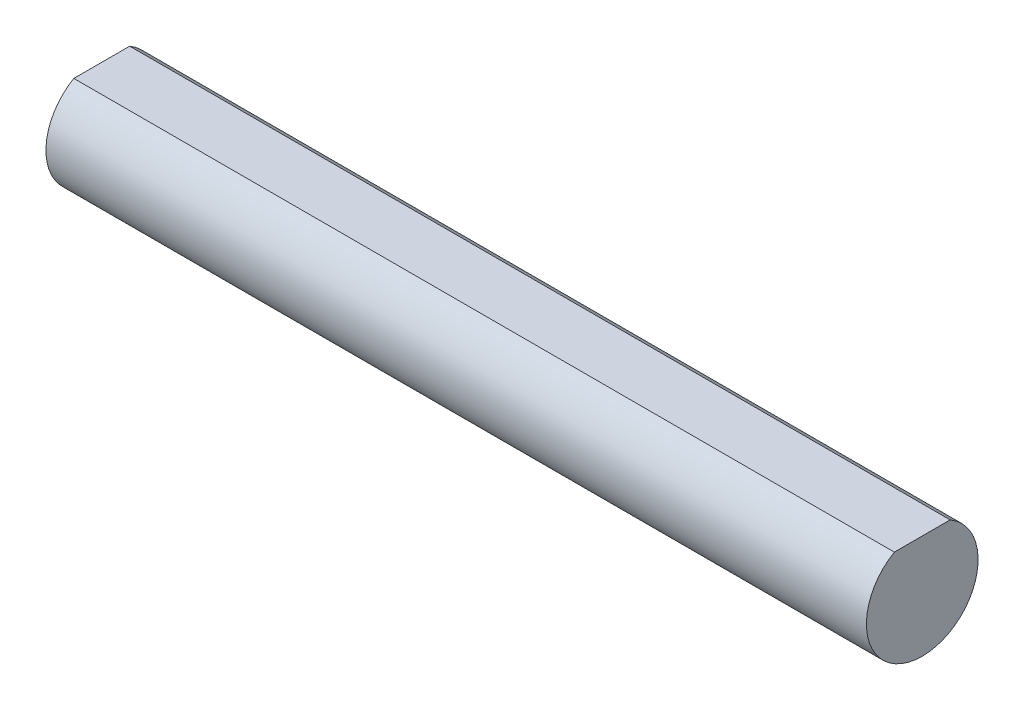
ISO-10303-21;
HEADER;
FILE_DESCRIPTION(('STEP AP214'),'2;1');
FILE_NAME('part.step','',(''),(''),'','','');
FILE_SCHEMA(('AUTOMOTIVE_DESIGN { 1 0 10303 214 1 1 1 1 }'));
ENDSEC;
DATA;
#1=APPLICATION_CONTEXT('core data for automotive mechanical design processes');
#2=APPLICATION_PROTOCOL_DEFINITION('international standard','automotive_design',2000,#1);
#3=PRODUCT_CONTEXT('',#1,'mechanical');
#4=PRODUCT('Part','Part','',(#3));
#5=PRODUCT_RELATED_PRODUCT_CATEGORY('part','',(#4));
#6=PRODUCT_DEFINITION_FORMATION('','',#4);
#7=PRODUCT_DEFINITION_CONTEXT('part definition',#1,'design');
#8=PRODUCT_DEFINITION('design','',#6,#7);
#9=PRODUCT_DEFINITION_SHAPE('','',#8);
#10=(LENGTH_UNIT() NAMED_UNIT(*) SI_UNIT(.MILLI.,.METRE.));
#11=(NAMED_UNIT(*) PLANE_ANGLE_UNIT() SI_UNIT($,.RADIAN.));
#12=(NAMED_UNIT(*) SI_UNIT($,.STERADIAN.) SOLID_ANGLE_UNIT());
#13=UNCERTAINTY_MEASURE_WITH_UNIT(LENGTH_MEASURE(1.E-05),#10,'distance_accuracy_value','');
#14=(GEOMETRIC_REPRESENTATION_CONTEXT(3) GLOBAL_UNCERTAINTY_ASSIGNED_CONTEXT((#13)) GLOBAL_UNIT_ASSIGNED_CONTEXT((#10,
#11,#12)) REPRESENTATION_CONTEXT('',''));
#15=CARTESIAN_POINT('',(0.,0.,0.));
#16=DIRECTION('',(0.,0.,1.));
#17=DIRECTION('',(1.,0.,0.));
#18=AXIS2_PLACEMENT_3D('',#15,#16,#17);
#19=CARTESIAN_POINT('',(44.1,0.,0.));
#20=DIRECTION('',(-1.,0.,0.));
#21=DIRECTION('',(0.,0.,1.));
#22=AXIS2_PLACEMENT_3D('',#19,#20,#21);
#23=CYLINDRICAL_SURFACE('',#22,3.);
#24=CARTESIAN_POINT('',(0.,0.,0.));
#25=DIRECTION('',(1.,0.,0.));
#26=DIRECTION('',(0.,0.,-1.));
#27=AXIS2_PLACEMENT_3D('',#24,#25,#26);
#28=CIRCLE('',#27,3.);
#29=CARTESIAN_POINT('',(0.,2.59807621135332,1.5));
#30=VERTEX_POINT('',#29);
#31=CARTESIAN_POINT('',(0.,2.59807621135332,-1.5));
#32=VERTEX_POINT('',#31);
#33=EDGE_CURVE('E72',#30,#32,#28,.T.);
#34=ORIENTED_EDGE('',*,*,#33,.T.);
#35=DIRECTION('',(-1.,0.,0.));
#36=VECTOR('',#35,1.);
#37=CARTESIAN_POINT('',(44.1,2.59807621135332,-1.5));
#38=LINE('',#37,#36);
#39=CARTESIAN_POINT('',(44.1,2.59807621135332,-1.5));
#40=VERTEX_POINT('',#39);
#41=EDGE_CURVE('E11',#40,#32,#38,.T.);
#42=ORIENTED_EDGE('',*,*,#41,.F.);
#43=CARTESIAN_POINT('',(44.1,0.,0.));
#44=DIRECTION('',(1.,0.,0.));
#45=DIRECTION('',(0.,0.,-1.));
#46=AXIS2_PLACEMENT_3D('',#43,#44,#45);
#47=CIRCLE('',#46,3.);
#48=CARTESIAN_POINT('',(44.1,2.59807621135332,1.5));
#49=VERTEX_POINT('',#48);
#50=EDGE_CURVE('E71',#49,#40,#47,.T.);
#51=ORIENTED_EDGE('',*,*,#50,.F.);
#52=DIRECTION('',(-1.,0.,0.));
#53=VECTOR('',#52,1.);
#54=CARTESIAN_POINT('',(44.1,2.59807621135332,1.5));
#55=LINE('',#54,#53);
#56=EDGE_CURVE('E48',#49,#30,#55,.T.);
#57=ORIENTED_EDGE('',*,*,#56,.T.);
#58=EDGE_LOOP('',(#34,#42,#51,#57));
#59=FACE_BOUND('',#58,.T.);
#60=ADVANCED_FACE('F39',(#59),#23,.T.);
#61=CARTESIAN_POINT('',(44.1,2.59807621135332,-1.5));
#62=DIRECTION('',(0.,-1.,0.));
#63=DIRECTION('',(0.,0.,-1.));
#64=AXIS2_PLACEMENT_3D('',#61,#62,#63);
#65=PLANE('',#64);
#66=DIRECTION('',(0.,0.,1.));
#67=VECTOR('',#66,1.);
#68=CARTESIAN_POINT('',(0.,2.59807621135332,-1.5));
#69=LINE('',#68,#67);
#70=EDGE_CURVE('E63',#32,#30,#69,.T.);
#71=ORIENTED_EDGE('',*,*,#70,.T.);
#72=ORIENTED_EDGE('',*,*,#56,.F.);
#73=DIRECTION('',(0.,0.,1.));
#74=VECTOR('',#73,1.);
#75=CARTESIAN_POINT('',(44.1,2.59807621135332,-1.5));
#76=LINE('',#75,#74);
#77=EDGE_CURVE('E55',#40,#49,#76,.T.);
#78=ORIENTED_EDGE('',*,*,#77,.F.);
#79=ORIENTED_EDGE('',*,*,#41,.T.);
#80=EDGE_LOOP('',(#71,#72,#78,#79));
#81=FACE_BOUND('',#80,.T.);
#82=ADVANCED_FACE('F66',(#81),#65,.F.);
#83=CARTESIAN_POINT('',(44.1,0.,0.));
#84=DIRECTION('',(1.,0.,0.));
#85=DIRECTION('',(0.,0.,-1.));
#86=AXIS2_PLACEMENT_3D('',#83,#84,#85);
#87=PLANE('',#86);
#88=ORIENTED_EDGE('',*,*,#50,.T.);
#89=ORIENTED_EDGE('',*,*,#77,.T.);
#90=EDGE_LOOP('',(#88,#89));
#91=FACE_BOUND('',#90,.T.);
#92=ADVANCED_FACE('F83',(#91),#87,.T.);
#93=CARTESIAN_POINT('',(0.,0.,0.));
#94=DIRECTION('',(1.,0.,0.));
#95=DIRECTION('',(0.,0.,-1.));
#96=AXIS2_PLACEMENT_3D('',#93,#94,#95);
#97=PLANE('',#96);
#98=ORIENTED_EDGE('',*,*,#33,.F.);
#99=ORIENTED_EDGE('',*,*,#70,.F.);
#100=EDGE_LOOP('',(#98,#99));
#101=FACE_BOUND('',#100,.T.);
#102=ADVANCED_FACE('F76',(#101),#97,.F.);
#103=CLOSED_SHELL('',(#60,#82,#92,#102));
#104=MANIFOLD_SOLID_BREP('B2',#103);
#105=ADVANCED_BREP_SHAPE_REPRESENTATION('',(#18,#104),#14);
#106=SHAPE_DEFINITION_REPRESENTATION(#9,#105);
ENDSEC;
END-ISO-10303-21;
